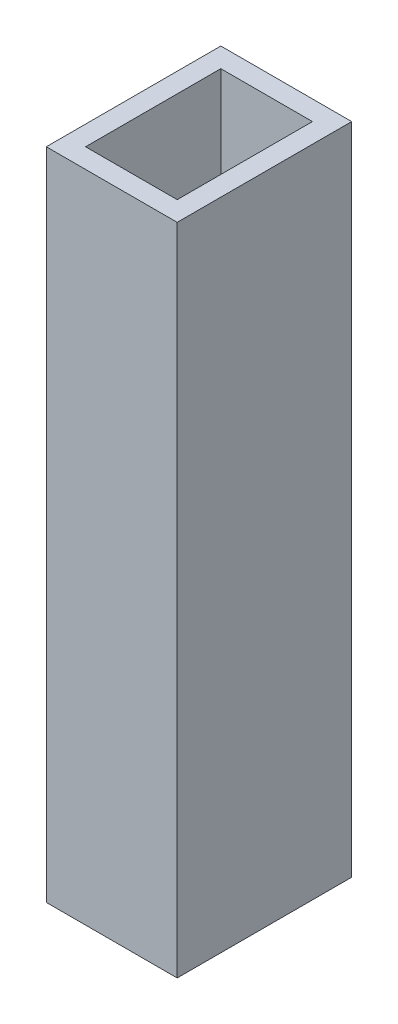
ISO-10303-21;
HEADER;
FILE_DESCRIPTION(('STEP AP214'),'2;1');
FILE_NAME('part.step','',(''),(''),'','','');
FILE_SCHEMA(('AUTOMOTIVE_DESIGN { 1 0 10303 214 1 1 1 1 }'));
ENDSEC;
DATA;
#1=APPLICATION_CONTEXT('core data for automotive mechanical design processes');
#2=APPLICATION_PROTOCOL_DEFINITION('international standard','automotive_design',2000,#1);
#3=PRODUCT_CONTEXT('',#1,'mechanical');
#4=PRODUCT('Part','Part','',(#3));
#5=PRODUCT_RELATED_PRODUCT_CATEGORY('part','',(#4));
#6=PRODUCT_DEFINITION_FORMATION('','',#4);
#7=PRODUCT_DEFINITION_CONTEXT('part definition',#1,'design');
#8=PRODUCT_DEFINITION('design','',#6,#7);
#9=PRODUCT_DEFINITION_SHAPE('','',#8);
#10=(LENGTH_UNIT() NAMED_UNIT(*) SI_UNIT(.MILLI.,.METRE.));
#11=(NAMED_UNIT(*) PLANE_ANGLE_UNIT() SI_UNIT($,.RADIAN.));
#12=(NAMED_UNIT(*) SI_UNIT($,.STERADIAN.) SOLID_ANGLE_UNIT());
#13=UNCERTAINTY_MEASURE_WITH_UNIT(LENGTH_MEASURE(1.E-05),#10,'distance_accuracy_value','');
#14=(GEOMETRIC_REPRESENTATION_CONTEXT(3) GLOBAL_UNCERTAINTY_ASSIGNED_CONTEXT((#13)) GLOBAL_UNIT_ASSIGNED_CONTEXT((#10,
#11,#12)) REPRESENTATION_CONTEXT('',''));
#15=CARTESIAN_POINT('',(0.,0.,0.));
#16=DIRECTION('',(0.,0.,1.));
#17=DIRECTION('',(1.,0.,0.));
#18=AXIS2_PLACEMENT_3D('',#15,#16,#17);
#19=CARTESIAN_POINT('',(0.,381.,0.));
#20=DIRECTION('',(-1.,0.,0.));
#21=DIRECTION('',(0.,0.,1.));
#22=AXIS2_PLACEMENT_3D('',#19,#20,#21);
#23=PLANE('',#22);
#24=DIRECTION('',(0.,0.,-1.));
#25=VECTOR('',#24,1.);
#26=CARTESIAN_POINT('',(0.,0.,0.));
#27=LINE('',#26,#25);
#28=CARTESIAN_POINT('',(0.,0.,0.));
#29=VERTEX_POINT('',#28);
#30=CARTESIAN_POINT('',(0.,0.,-101.6));
#31=VERTEX_POINT('',#30);
#32=EDGE_CURVE('E134',#29,#31,#27,.T.);
#33=ORIENTED_EDGE('',*,*,#32,.T.);
#34=DIRECTION('',(0.,-1.,0.));
#35=VECTOR('',#34,1.);
#36=CARTESIAN_POINT('',(0.,381.,-101.6));
#37=LINE('',#36,#35);
#38=CARTESIAN_POINT('',(0.,381.,-101.6));
#39=VERTEX_POINT('',#38);
#40=EDGE_CURVE('E11',#39,#31,#37,.T.);
#41=ORIENTED_EDGE('',*,*,#40,.F.);
#42=DIRECTION('',(0.,0.,-1.));
#43=VECTOR('',#42,1.);
#44=CARTESIAN_POINT('',(0.,381.,0.));
#45=LINE('',#44,#43);
#46=CARTESIAN_POINT('',(0.,381.,0.));
#47=VERTEX_POINT('',#46);
#48=EDGE_CURVE('E145',#47,#39,#45,.T.);
#49=ORIENTED_EDGE('',*,*,#48,.F.);
#50=DIRECTION('',(0.,-1.,0.));
#51=VECTOR('',#50,1.);
#52=CARTESIAN_POINT('',(0.,381.,0.));
#53=LINE('',#52,#51);
#54=EDGE_CURVE('E152',#47,#29,#53,.T.);
#55=ORIENTED_EDGE('',*,*,#54,.T.);
#56=EDGE_LOOP('',(#33,#41,#49,#55));
#57=FACE_BOUND('',#56,.T.);
#58=ADVANCED_FACE('F32',(#57),#23,.F.);
#59=CARTESIAN_POINT('',(0.,381.,-101.6));
#60=DIRECTION('',(0.,0.,1.));
#61=DIRECTION('',(1.,0.,0.));
#62=AXIS2_PLACEMENT_3D('',#59,#60,#61);
#63=PLANE('',#62);
#64=DIRECTION('',(-1.,0.,0.));
#65=VECTOR('',#64,1.);
#66=CARTESIAN_POINT('',(0.,0.,-101.6));
#67=LINE('',#66,#65);
#68=CARTESIAN_POINT('',(-76.2,0.,-101.6));
#69=VERTEX_POINT('',#68);
#70=EDGE_CURVE('E139',#31,#69,#67,.T.);
#71=ORIENTED_EDGE('',*,*,#70,.T.);
#72=DIRECTION('',(0.,-1.,0.));
#73=VECTOR('',#72,1.);
#74=CARTESIAN_POINT('',(-76.2,381.,-101.6));
#75=LINE('',#74,#73);
#76=CARTESIAN_POINT('',(-76.2,381.,-101.6));
#77=VERTEX_POINT('',#76);
#78=EDGE_CURVE('E39',#77,#69,#75,.T.);
#79=ORIENTED_EDGE('',*,*,#78,.F.);
#80=DIRECTION('',(-1.,0.,0.));
#81=VECTOR('',#80,1.);
#82=CARTESIAN_POINT('',(0.,381.,-101.6));
#83=LINE('',#82,#81);
#84=EDGE_CURVE('E147',#39,#77,#83,.T.);
#85=ORIENTED_EDGE('',*,*,#84,.F.);
#86=ORIENTED_EDGE('',*,*,#40,.T.);
#87=EDGE_LOOP('',(#71,#79,#85,#86));
#88=FACE_BOUND('',#87,.T.);
#89=ADVANCED_FACE('F174',(#88),#63,.F.);
#90=CARTESIAN_POINT('',(-76.2,381.,0.));
#91=DIRECTION('',(1.,0.,0.));
#92=DIRECTION('',(0.,0.,-1.));
#93=AXIS2_PLACEMENT_3D('',#90,#91,#92);
#94=PLANE('',#93);
#95=DIRECTION('',(0.,0.,1.));
#96=VECTOR('',#95,1.);
#97=CARTESIAN_POINT('',(-76.2,0.,0.));
#98=LINE('',#97,#96);
#99=CARTESIAN_POINT('',(-76.2,0.,0.));
#100=VERTEX_POINT('',#99);
#101=EDGE_CURVE('E141',#69,#100,#98,.T.);
#102=ORIENTED_EDGE('',*,*,#101,.T.);
#103=DIRECTION('',(0.,-1.,0.));
#104=VECTOR('',#103,1.);
#105=CARTESIAN_POINT('',(-76.2,381.,0.));
#106=LINE('',#105,#104);
#107=CARTESIAN_POINT('',(-76.2,381.,0.));
#108=VERTEX_POINT('',#107);
#109=EDGE_CURVE('E155',#108,#100,#106,.T.);
#110=ORIENTED_EDGE('',*,*,#109,.F.);
#111=DIRECTION('',(0.,0.,1.));
#112=VECTOR('',#111,1.);
#113=CARTESIAN_POINT('',(-76.2,381.,0.));
#114=LINE('',#113,#112);
#115=EDGE_CURVE('E149',#77,#108,#114,.T.);
#116=ORIENTED_EDGE('',*,*,#115,.F.);
#117=ORIENTED_EDGE('',*,*,#78,.T.);
#118=EDGE_LOOP('',(#102,#110,#116,#117));
#119=FACE_BOUND('',#118,.T.);
#120=ADVANCED_FACE('F162',(#119),#94,.F.);
#121=CARTESIAN_POINT('',(0.,381.,0.));
#122=DIRECTION('',(0.,0.,-1.));
#123=DIRECTION('',(-1.,0.,0.));
#124=AXIS2_PLACEMENT_3D('',#121,#122,#123);
#125=PLANE('',#124);
#126=DIRECTION('',(1.,0.,0.));
#127=VECTOR('',#126,1.);
#128=CARTESIAN_POINT('',(0.,0.,0.));
#129=LINE('',#128,#127);
#130=EDGE_CURVE('E143',#100,#29,#129,.T.);
#131=ORIENTED_EDGE('',*,*,#130,.T.);
#132=ORIENTED_EDGE('',*,*,#54,.F.);
#133=DIRECTION('',(1.,0.,0.));
#134=VECTOR('',#133,1.);
#135=CARTESIAN_POINT('',(0.,381.,0.));
#136=LINE('',#135,#134);
#137=EDGE_CURVE('E54',#108,#47,#136,.T.);
#138=ORIENTED_EDGE('',*,*,#137,.F.);
#139=ORIENTED_EDGE('',*,*,#109,.T.);
#140=EDGE_LOOP('',(#131,#132,#138,#139));
#141=FACE_BOUND('',#140,.T.);
#142=ADVANCED_FACE('F170',(#141),#125,.F.);
#143=CARTESIAN_POINT('',(0.,381.,0.));
#144=DIRECTION('',(0.,1.,0.));
#145=DIRECTION('',(0.,0.,1.));
#146=AXIS2_PLACEMENT_3D('',#143,#144,#145);
#147=PLANE('',#146);
#148=DIRECTION('',(1.,0.,0.));
#149=VECTOR('',#148,1.);
#150=CARTESIAN_POINT('',(-64.77,381.,-11.43));
#151=LINE('',#150,#149);
#152=CARTESIAN_POINT('',(-64.77,381.,-11.43));
#153=VERTEX_POINT('',#152);
#154=CARTESIAN_POINT('',(-11.43,381.,-11.43));
#155=VERTEX_POINT('',#154);
#156=EDGE_CURVE('E46',#153,#155,#151,.T.);
#157=ORIENTED_EDGE('',*,*,#156,.F.);
#158=DIRECTION('',(0.,0.,1.));
#159=VECTOR('',#158,1.);
#160=CARTESIAN_POINT('',(-64.77,381.,-90.17));
#161=LINE('',#160,#159);
#162=CARTESIAN_POINT('',(-64.77,381.,-90.17));
#163=VERTEX_POINT('',#162);
#164=EDGE_CURVE('E118',#163,#153,#161,.T.);
#165=ORIENTED_EDGE('',*,*,#164,.F.);
#166=DIRECTION('',(-1.,0.,0.));
#167=VECTOR('',#166,1.);
#168=CARTESIAN_POINT('',(-11.43,381.,-90.17));
#169=LINE('',#168,#167);
#170=CARTESIAN_POINT('',(-11.43,381.,-90.17));
#171=VERTEX_POINT('',#170);
#172=EDGE_CURVE('E101',#171,#163,#169,.T.);
#173=ORIENTED_EDGE('',*,*,#172,.F.);
#174=DIRECTION('',(0.,0.,-1.));
#175=VECTOR('',#174,1.);
#176=CARTESIAN_POINT('',(-11.43,381.,-11.43));
#177=LINE('',#176,#175);
#178=EDGE_CURVE('E112',#155,#171,#177,.T.);
#179=ORIENTED_EDGE('',*,*,#178,.F.);
#180=EDGE_LOOP('',(#157,#165,#173,#179));
#181=FACE_BOUND('',#180,.T.);
#182=ORIENTED_EDGE('',*,*,#48,.T.);
#183=ORIENTED_EDGE('',*,*,#84,.T.);
#184=ORIENTED_EDGE('',*,*,#115,.T.);
#185=ORIENTED_EDGE('',*,*,#137,.T.);
#186=EDGE_LOOP('',(#182,#183,#184,#185));
#187=FACE_BOUND('',#186,.T.);
#188=ADVANCED_FACE('F116',(#181,#187),#147,.T.);
#189=CARTESIAN_POINT('',(0.,0.,0.));
#190=DIRECTION('',(0.,1.,0.));
#191=DIRECTION('',(0.,0.,1.));
#192=AXIS2_PLACEMENT_3D('',#189,#190,#191);
#193=PLANE('',#192);
#194=ORIENTED_EDGE('',*,*,#32,.F.);
#195=ORIENTED_EDGE('',*,*,#130,.F.);
#196=ORIENTED_EDGE('',*,*,#101,.F.);
#197=ORIENTED_EDGE('',*,*,#70,.F.);
#198=EDGE_LOOP('',(#194,#195,#196,#197));
#199=FACE_BOUND('',#198,.T.);
#200=ADVANCED_FACE('F168',(#199),#193,.F.);
#201=CARTESIAN_POINT('',(-64.77,246.38,-11.43));
#202=DIRECTION('',(0.,0.,1.));
#203=DIRECTION('',(1.,0.,0.));
#204=AXIS2_PLACEMENT_3D('',#201,#202,#203);
#205=PLANE('',#204);
#206=ORIENTED_EDGE('',*,*,#156,.T.);
#207=DIRECTION('',(0.,1.,0.));
#208=VECTOR('',#207,1.);
#209=CARTESIAN_POINT('',(-11.43,246.38,-11.43));
#210=LINE('',#209,#208);
#211=CARTESIAN_POINT('',(-11.43,246.38,-11.43));
#212=VERTEX_POINT('',#211);
#213=EDGE_CURVE('E109',#212,#155,#210,.T.);
#214=ORIENTED_EDGE('',*,*,#213,.F.);
#215=DIRECTION('',(1.,0.,0.));
#216=VECTOR('',#215,1.);
#217=CARTESIAN_POINT('',(-64.77,246.38,-11.43));
#218=LINE('',#217,#216);
#219=CARTESIAN_POINT('',(-64.77,246.38,-11.43));
#220=VERTEX_POINT('',#219);
#221=EDGE_CURVE('E120',#220,#212,#218,.T.);
#222=ORIENTED_EDGE('',*,*,#221,.F.);
#223=DIRECTION('',(0.,1.,0.));
#224=VECTOR('',#223,1.);
#225=CARTESIAN_POINT('',(-64.77,246.38,-11.43));
#226=LINE('',#225,#224);
#227=EDGE_CURVE('E132',#220,#153,#226,.T.);
#228=ORIENTED_EDGE('',*,*,#227,.T.);
#229=EDGE_LOOP('',(#206,#214,#222,#228));
#230=FACE_BOUND('',#229,.T.);
#231=ADVANCED_FACE('F188',(#230),#205,.F.);
#232=CARTESIAN_POINT('',(-64.77,246.38,-90.17));
#233=DIRECTION('',(-1.,0.,0.));
#234=DIRECTION('',(0.,0.,1.));
#235=AXIS2_PLACEMENT_3D('',#232,#233,#234);
#236=PLANE('',#235);
#237=ORIENTED_EDGE('',*,*,#164,.T.);
#238=ORIENTED_EDGE('',*,*,#227,.F.);
#239=DIRECTION('',(0.,0.,1.));
#240=VECTOR('',#239,1.);
#241=CARTESIAN_POINT('',(-64.77,246.38,-90.17));
#242=LINE('',#241,#240);
#243=CARTESIAN_POINT('',(-64.77,246.38,-90.17));
#244=VERTEX_POINT('',#243);
#245=EDGE_CURVE('E129',#244,#220,#242,.T.);
#246=ORIENTED_EDGE('',*,*,#245,.F.);
#247=DIRECTION('',(0.,1.,0.));
#248=VECTOR('',#247,1.);
#249=CARTESIAN_POINT('',(-64.77,246.38,-90.17));
#250=LINE('',#249,#248);
#251=EDGE_CURVE('E108',#244,#163,#250,.T.);
#252=ORIENTED_EDGE('',*,*,#251,.T.);
#253=EDGE_LOOP('',(#237,#238,#246,#252));
#254=FACE_BOUND('',#253,.T.);
#255=ADVANCED_FACE('F191',(#254),#236,.F.);
#256=CARTESIAN_POINT('',(-11.43,246.38,-90.17));
#257=DIRECTION('',(0.,0.,-1.));
#258=DIRECTION('',(-1.,0.,0.));
#259=AXIS2_PLACEMENT_3D('',#256,#257,#258);
#260=PLANE('',#259);
#261=ORIENTED_EDGE('',*,*,#172,.T.);
#262=ORIENTED_EDGE('',*,*,#251,.F.);
#263=DIRECTION('',(-1.,0.,0.));
#264=VECTOR('',#263,1.);
#265=CARTESIAN_POINT('',(-11.43,246.38,-90.17));
#266=LINE('',#265,#264);
#267=CARTESIAN_POINT('',(-11.43,246.38,-90.17));
#268=VERTEX_POINT('',#267);
#269=EDGE_CURVE('E104',#268,#244,#266,.T.);
#270=ORIENTED_EDGE('',*,*,#269,.F.);
#271=DIRECTION('',(0.,1.,0.));
#272=VECTOR('',#271,1.);
#273=CARTESIAN_POINT('',(-11.43,246.38,-90.17));
#274=LINE('',#273,#272);
#275=EDGE_CURVE('E97',#268,#171,#274,.T.);
#276=ORIENTED_EDGE('',*,*,#275,.T.);
#277=EDGE_LOOP('',(#261,#262,#270,#276));
#278=FACE_BOUND('',#277,.T.);
#279=ADVANCED_FACE('F99',(#278),#260,.F.);
#280=CARTESIAN_POINT('',(-11.43,246.38,-11.43));
#281=DIRECTION('',(1.,0.,0.));
#282=DIRECTION('',(0.,0.,-1.));
#283=AXIS2_PLACEMENT_3D('',#280,#281,#282);
#284=PLANE('',#283);
#285=ORIENTED_EDGE('',*,*,#178,.T.);
#286=ORIENTED_EDGE('',*,*,#275,.F.);
#287=DIRECTION('',(0.,0.,-1.));
#288=VECTOR('',#287,1.);
#289=CARTESIAN_POINT('',(-11.43,246.38,-11.43));
#290=LINE('',#289,#288);
#291=EDGE_CURVE('E126',#212,#268,#290,.T.);
#292=ORIENTED_EDGE('',*,*,#291,.F.);
#293=ORIENTED_EDGE('',*,*,#213,.T.);
#294=EDGE_LOOP('',(#285,#286,#292,#293));
#295=FACE_BOUND('',#294,.T.);
#296=ADVANCED_FACE('F113',(#295),#284,.F.);
#297=CARTESIAN_POINT('',(-11.43,246.38,-11.43));
#298=DIRECTION('',(0.,1.,0.));
#299=DIRECTION('',(0.,0.,1.));
#300=AXIS2_PLACEMENT_3D('',#297,#298,#299);
#301=PLANE('',#300);
#302=ORIENTED_EDGE('',*,*,#221,.T.);
#303=ORIENTED_EDGE('',*,*,#291,.T.);
#304=ORIENTED_EDGE('',*,*,#269,.T.);
#305=ORIENTED_EDGE('',*,*,#245,.T.);
#306=EDGE_LOOP('',(#302,#303,#304,#305));
#307=FACE_BOUND('',#306,.T.);
#308=ADVANCED_FACE('F194',(#307),#301,.T.);
#309=CLOSED_SHELL('',(#58,#89,#120,#142,#188,#200,#231,#255,#279,#296,#308));
#310=MANIFOLD_SOLID_BREP('B2',#309);
#311=ADVANCED_BREP_SHAPE_REPRESENTATION('',(#18,#310),#14);
#312=SHAPE_DEFINITION_REPRESENTATION(#9,#311);
ENDSEC;
END-ISO-10303-21;
